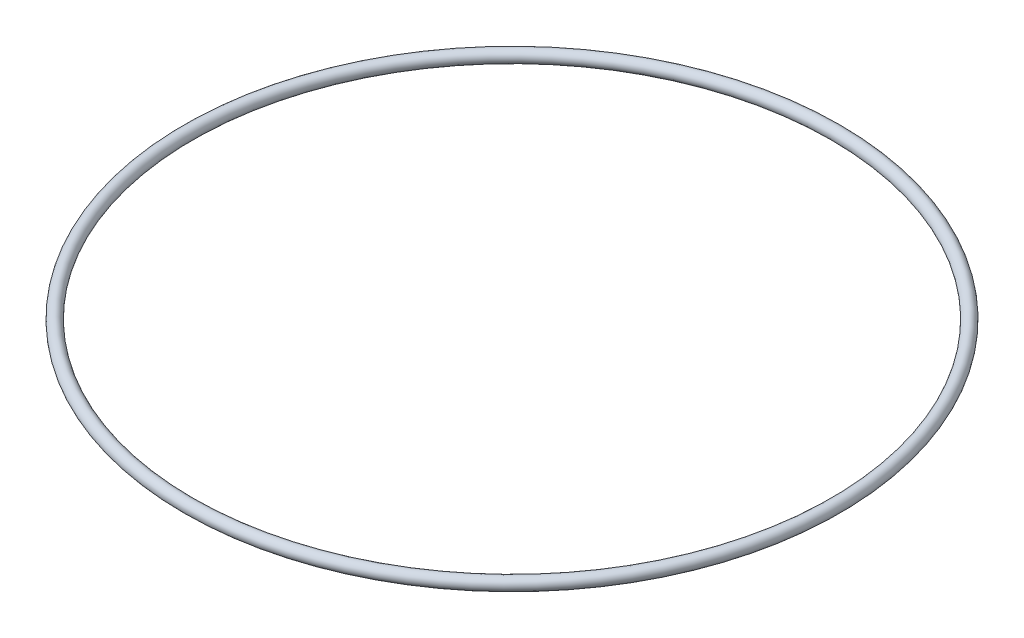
ISO-10303-21;
HEADER;
FILE_DESCRIPTION(('STEP AP214'),'2;1');
FILE_NAME('part.step','',(''),(''),'','','');
FILE_SCHEMA(('AUTOMOTIVE_DESIGN { 1 0 10303 214 1 1 1 1 }'));
ENDSEC;
DATA;
#1=APPLICATION_CONTEXT('core data for automotive mechanical design processes');
#2=APPLICATION_PROTOCOL_DEFINITION('international standard','automotive_design',2000,#1);
#3=PRODUCT_CONTEXT('',#1,'mechanical');
#4=PRODUCT('Part','Part','',(#3));
#5=PRODUCT_RELATED_PRODUCT_CATEGORY('part','',(#4));
#6=PRODUCT_DEFINITION_FORMATION('','',#4);
#7=PRODUCT_DEFINITION_CONTEXT('part definition',#1,'design');
#8=PRODUCT_DEFINITION('design','',#6,#7);
#9=PRODUCT_DEFINITION_SHAPE('','',#8);
#10=(LENGTH_UNIT() NAMED_UNIT(*) SI_UNIT(.MILLI.,.METRE.));
#11=(NAMED_UNIT(*) PLANE_ANGLE_UNIT() SI_UNIT($,.RADIAN.));
#12=(NAMED_UNIT(*) SI_UNIT($,.STERADIAN.) SOLID_ANGLE_UNIT());
#13=UNCERTAINTY_MEASURE_WITH_UNIT(LENGTH_MEASURE(1.E-05),#10,'distance_accuracy_value','');
#14=(GEOMETRIC_REPRESENTATION_CONTEXT(3) GLOBAL_UNCERTAINTY_ASSIGNED_CONTEXT((#13)) GLOBAL_UNIT_ASSIGNED_CONTEXT((#10,
#11,#12)) REPRESENTATION_CONTEXT('',''));
#15=CARTESIAN_POINT('',(0.,0.,0.));
#16=DIRECTION('',(0.,0.,1.));
#17=DIRECTION('',(1.,0.,0.));
#18=AXIS2_PLACEMENT_3D('',#15,#16,#17);
#19=CARTESIAN_POINT('',(0.,0.,0.));
#20=DIRECTION('',(0.,1.,0.));
#21=DIRECTION('',(0.,0.,1.));
#22=AXIS2_PLACEMENT_3D('',#19,#20,#21);
#23=TOROIDAL_SURFACE('',#22,131.25,2.5);
#24=CARTESIAN_POINT('',(0.,0.,133.75));
#25=VERTEX_POINT('',#24);
#26=VERTEX_LOOP('',#25);
#27=FACE_BOUND('',#26,.T.);
#28=ADVANCED_FACE('F28',(#27),#23,.T.);
#29=CLOSED_SHELL('',(#28));
#30=MANIFOLD_SOLID_BREP('B2',#29);
#31=ADVANCED_BREP_SHAPE_REPRESENTATION('',(#18,#30),#14);
#32=SHAPE_DEFINITION_REPRESENTATION(#9,#31);
ENDSEC;
END-ISO-10303-21;
